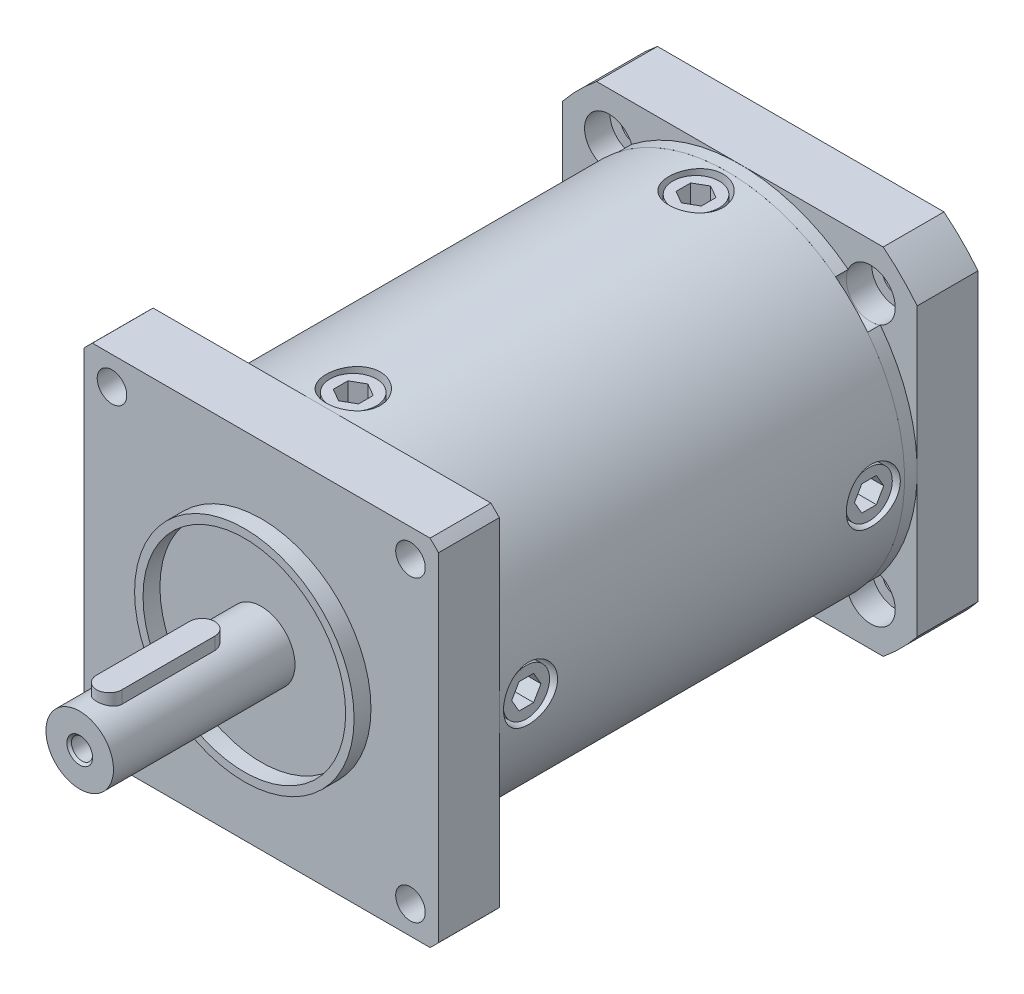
from build123d import *

# Parameters (mm, degrees)
SKETCH_1_R                   = 1.75
EXTRUDE_2_DEPTH              = 7.2
SKETCH_15_R                  = 21
EXTRUDE_8_DEPTH              = 48
SKETCH_17_R                  = 13
SKETCH_17_R_2                = 12
EXTRUDE_9_DEPTH              = 2
SKETCH_18_R                  = 4
EXTRUDE_10_DEPTH             = 21.5
HOLE_WIZARD_M3_1_D           = 2.5
HOLE_WIZARD_M3_1_DEPTH       = 11
HOLE_WIZARD_M3_1_CSINK_D     = 3.05
HOLE_WIZARD_M3_1_CSINK_ANGLE = 90
HOLE_WIZARD_M3_1_TIP         = 0.751075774
EXTRUDE_START                = 2.2
EXTRUDE_11_DEPTH             = 3
SKETCH_25_R                  = 21
EXTRUDE_12_DEPTH             = 1.5
SKETCH_26_R                  = 1.6
EXTRUDE_13_DEPTH             = 7.2
SKETCH_27_R                  = 11
CUT_EXTRUDE_1_DEPTH          = 3
SKETCH_28_R                  = 10
CUT_EXTRUDE_2_DEPTH          = 10
SKETCH_29_R                  = 7.5
EXTRUDE_14_DEPTH             = 8
CUT_EXTRUDE_3_DEPTH          = 7
SKETCH_37_R                  = 2.9
CUT_EXTRUDE_4_DEPTH          = 4.5
SKETCH_38_R                  = 3.2
CUT_EXTRUDE_5_DEPTH          = 3.5
SKETCH_39_R                  = 2.75
EXTRUDE_15_DEPTH             = 3
CUT_EXTRUDE_6_DEPTH          = 3
PATTERN_CIRCULAR_1_COUNT     = 4


with BuildPart() as part:
    # Sketch 1 → Extrude 2 (new body)
    with BuildSketch(Plane.XY):
        with BuildLine():
            Line((-20, -21), (20, -21))
            ThreePointArc((20, -21), (20.506096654, -20.506096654), (21, -20))
            Line((21, -20), (21, 20))
            ThreePointArc((21, 20), (20.506096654, 20.506096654), (20, 21))
            Line((20, 21), (-20, 21))
            ThreePointArc((-20, 21), (-20.506096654, 20.506096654), (-21, 20))
            Line((-21, 20), (-21, -20))
            ThreePointArc((-21, -20), (-20.506096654, -20.506096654), (-20, -21))
        make_face()
        with Locations((-17.67766953, 17.67766953)):
            Circle(SKETCH_1_R, mode=Mode.SUBTRACT)
        with Locations((17.67766953, 17.67766953)):
            Circle(SKETCH_1_R, mode=Mode.SUBTRACT)
        with Locations((17.67766953, -17.67766953)):
            Circle(SKETCH_1_R, mode=Mode.SUBTRACT)
        with Locations((-17.67766953, -17.67766953)):
            Circle(SKETCH_1_R, mode=Mode.SUBTRACT)
    extrude(amount=EXTRUDE_2_DEPTH)

    # Sketch 15 → Extrude 8 (add)
    with BuildSketch(Plane(origin=(0, 0, 0), x_dir=(-1, 0, 0), z_dir=(0, 0, -1))):
        Circle(SKETCH_15_R)
    extrude(amount=EXTRUDE_8_DEPTH)

    # Sketch 17 → Extrude 9 (add)
    with BuildSketch(Plane.XY.offset(7.2)):
        Circle(SKETCH_17_R)
        Circle(SKETCH_17_R_2, mode=Mode.SUBTRACT)
    extrude(amount=EXTRUDE_9_DEPTH)

    # Sketch 18 → Extrude 10 (add)
    with BuildSketch(Plane.XY.offset(7.2)):
        Circle(SKETCH_18_R)
    extrude(amount=EXTRUDE_10_DEPTH)

    # Hole Wizard M3 _1
    with Locations(Plane.XY.offset(28.7)):
        with Locations((0, 0)):
            CounterSinkHole(HOLE_WIZARD_M3_1_D / 2, HOLE_WIZARD_M3_1_CSINK_D / 2, depth=HOLE_WIZARD_M3_1_DEPTH, counter_sink_angle=HOLE_WIZARD_M3_1_CSINK_ANGLE)
            with Locations((0, 0, -(HOLE_WIZARD_M3_1_DEPTH + HOLE_WIZARD_M3_1_TIP / 2))):  # 118° drill point
                Cone(0, HOLE_WIZARD_M3_1_D / 2, HOLE_WIZARD_M3_1_TIP, mode=Mode.SUBTRACT)

    # Sketch 24 → Extrude 11 (add)
    with BuildSketch(Plane(origin=(0, 0, 0), x_dir=(1, 0, 0), z_dir=(0, 1, 0)).offset(EXTRUDE_START)):
        with BuildLine():
            Line((1.5, -14.2), (1.5, -25.2))
            ThreePointArc((1.5, -25.2), (0, -26.7), (-1.5, -25.2))
            Line((-1.5, -25.2), (-1.5, -14.2))
            ThreePointArc((-1.5, -14.2), (0, -12.7), (1.5, -14.2))
        make_face()
    extrude(amount=EXTRUDE_11_DEPTH)


with BuildPart() as body_2:
    # Sketch 25 → Extrude 12 (new body)
    with BuildSketch(Plane(origin=(0, 0, -48), x_dir=(-1, 0, 0), z_dir=(0, 0, -1))):
        Circle(SKETCH_25_R)
    extrude(amount=EXTRUDE_12_DEPTH)


with BuildPart() as body_3:
    # Sketch 26 → Extrude 13 (new body)
    with BuildSketch(Plane(origin=(0, 0, -49.5), x_dir=(-1, 0, 0), z_dir=(0, 0, -1))):
        with BuildLine():
            Line((-16.970562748, 21), (16.970562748, 21))
            ThreePointArc((16.970562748, 21), (19.091883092, 19.091883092), (21, 16.970562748))
            Line((21, 16.970562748), (21, -16.970562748))
            ThreePointArc((21, -16.970562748), (19.091883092, -19.091883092), (16.970562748, -21))
            Line((16.970562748, -21), (-16.970562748, -21))
            ThreePointArc((-16.970562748, -21), (-19.091883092, -19.091883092), (-21, -16.970562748))
            Line((-21, -16.970562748), (-21, 16.970562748))
            ThreePointArc((-21, 16.970562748), (-19.091883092, 19.091883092), (-16.970562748, 21))
        make_face()
        with Locations((-15.5, 15.5)):
            Circle(SKETCH_26_R, mode=Mode.SUBTRACT)
        with Locations((15.5, 15.5)):
            Circle(SKETCH_26_R, mode=Mode.SUBTRACT)
        with Locations((15.5, -15.5)):
            Circle(SKETCH_26_R, mode=Mode.SUBTRACT)
        with Locations((-15.5, -15.5)):
            Circle(SKETCH_26_R, mode=Mode.SUBTRACT)
    extrude(amount=EXTRUDE_13_DEPTH)

    # Sketch 27 → Cut-Extrude 1 (cut)
    with BuildSketch(Plane(origin=(0, 0, -56.7), x_dir=(-1, 0, 0), z_dir=(0, 0, -1))):
        Circle(SKETCH_27_R)
    extrude(amount=-CUT_EXTRUDE_1_DEPTH, mode=Mode.SUBTRACT)


with BuildPart() as cut_extrude_2_tool:
    # Sketch 28 → Cut-Extrude 2 (new body)
    with BuildSketch(Plane(origin=(0, 0, -53.7), x_dir=(-1, 0, 0), z_dir=(0, 0, -1))):
        Circle(SKETCH_28_R)
    extrude(amount=-CUT_EXTRUDE_2_DEPTH)


with BuildPart() as part_1:
    add(part.part)

    # Cut-Extrude 2: cut by cut_extrude_2_tool
    add(cut_extrude_2_tool.part, mode=Mode.SUBTRACT)

    # Sketch 38 → Cut-Extrude 5 (cut)
    with BuildSketch(Plane(origin=(21, 0, 0), x_dir=(0, 0, -1), z_dir=(1, 0, 0))):
        with Locations((3.7, 0)):
            Circle(SKETCH_38_R)
        with Locations((44.3, 0)):
            Circle(SKETCH_38_R)
    cut_extrude_5 = extrude(amount=-CUT_EXTRUDE_5_DEPTH, mode=Mode.SUBTRACT)

    # Sketch 39 → Extrude 15 (add)
    with BuildSketch(Plane(origin=(17.5, 0, 0), x_dir=(0, 0, -1), z_dir=(1, 0, 0))):
        with Locations((3.7, 0)):
            Circle(SKETCH_39_R)
        with Locations((44.3, 0)):
            Circle(SKETCH_39_R)
    extrude_15 = extrude(amount=EXTRUDE_15_DEPTH)

    # Sketch 40 → Cut-Extrude 6 (cut)
    with BuildSketch(Plane(origin=(20.5, 0, 0), x_dir=(0, 0, -1), z_dir=(1, 0, 0))):
        Polygon((5.432050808, 0), (4.566025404, 1.5), (2.833974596, 1.5), (1.967949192, 0), (2.833974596, -1.5), (4.566025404, -1.5), align=None)
        Polygon((42.567949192, 0), (43.433974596, -1.5), (45.166025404, -1.5), (46.032050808, 0), (45.166025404, 1.5), (43.433974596, 1.5), align=None)
    cut_extrude_6 = extrude(amount=-CUT_EXTRUDE_6_DEPTH, mode=Mode.SUBTRACT)

    # Pattern Circular 1: Cut-Extrude 5, Extrude 15, Cut-Extrude 6 ×4 about axis
    pattern_circular_1_axis = Axis((0, 0, 0), (0, 0, 1))
    add([cut_extrude_5.rotate(pattern_circular_1_axis, i * 360 / PATTERN_CIRCULAR_1_COUNT) for i in range(1, PATTERN_CIRCULAR_1_COUNT)], mode=Mode.SUBTRACT)
    add([extrude_15.rotate(pattern_circular_1_axis, i * 360 / PATTERN_CIRCULAR_1_COUNT) for i in range(1, PATTERN_CIRCULAR_1_COUNT)])
    add([cut_extrude_6.rotate(pattern_circular_1_axis, i * 360 / PATTERN_CIRCULAR_1_COUNT) for i in range(1, PATTERN_CIRCULAR_1_COUNT)], mode=Mode.SUBTRACT)


with BuildPart() as body_2_1:
    add(body_2.part)

    # Cut-Extrude 2: cut by cut_extrude_2_tool
    add(cut_extrude_2_tool.part, mode=Mode.SUBTRACT)


with BuildPart() as body_3_1:
    add(body_3.part)

    # Cut-Extrude 2: cut by cut_extrude_2_tool
    add(cut_extrude_2_tool.part, mode=Mode.SUBTRACT)


with BuildPart() as body_4:
    # Sketch 29 → Extrude 14 (new body)
    with BuildSketch(Plane(origin=(0, 0, -43.7), x_dir=(-1, 0, 0), z_dir=(0, 0, -1))):
        Circle(SKETCH_29_R)
    extrude(amount=EXTRUDE_14_DEPTH)

    # Sketch 30 → Cut-Extrude 3 (cut)
    with BuildSketch(Plane(origin=(0, 0, -51.7), x_dir=(-1, 0, 0), z_dir=(0, 0, -1))):
        with BuildLine():
            Line((-1.5, 2), (1.5, 2))
            ThreePointArc((1.5, 2), (0, -2.5), (-1.5, 2))
        make_face()
    extrude(amount=-CUT_EXTRUDE_3_DEPTH, mode=Mode.SUBTRACT)


with BuildPart() as hole_wizard_m3_2_tool:
    # Sketch 33 → Hole Wizard M3 _2 (revolve)
    with BuildSketch(Plane(origin=(0, 2, -49.759714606), x_dir=(0, 0, -1), z_dir=(1, 0, 0))):
        Polygon((0, 0), (0, 8.251075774), (1.25, 7.5), (1.25, 0), align=None)
    revolve(axis=Axis((0, -4.35, -49.759714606), (0, 1, 0)))


with BuildPart() as body_2_2:
    add(body_2_1.part)

    # Hole Wizard M3 _2: cut by hole_wizard_m3_2_tool
    add(hole_wizard_m3_2_tool.part, mode=Mode.SUBTRACT)


with BuildPart() as body_3_2:
    add(body_3_1.part)

    # Hole Wizard M3 _2: cut by hole_wizard_m3_2_tool
    add(hole_wizard_m3_2_tool.part, mode=Mode.SUBTRACT)


with BuildPart() as body_4_1:
    add(body_4.part)

    # Hole Wizard M3 _2: cut by hole_wizard_m3_2_tool
    add(hole_wizard_m3_2_tool.part, mode=Mode.SUBTRACT)


with BuildPart() as cut_extrude_4_tool:
    # Sketch 37 → Cut-Extrude 4 (new body)
    with BuildSketch(Plane.XY.offset(-48)):
        with Locations((15.5, 15.5)):
            Circle(SKETCH_37_R)
        with Locations((15.5, -15.5)):
            Circle(SKETCH_37_R)
        with Locations((-15.5, -15.5)):
            Circle(SKETCH_37_R)
        with Locations((-15.5, 15.5)):
            Circle(SKETCH_37_R)
    extrude(amount=-CUT_EXTRUDE_4_DEPTH)


with BuildPart() as body_2_3:
    add(body_2_2.part)

    # Cut-Extrude 4: cut by cut_extrude_4_tool
    add(cut_extrude_4_tool.part, mode=Mode.SUBTRACT)


with BuildPart() as body_3_3:
    add(body_3_2.part)

    # Cut-Extrude 4: cut by cut_extrude_4_tool
    add(cut_extrude_4_tool.part, mode=Mode.SUBTRACT)


solid = Compound([part_1.part, body_4_1.part, body_2_3.part, body_3_3.part])
